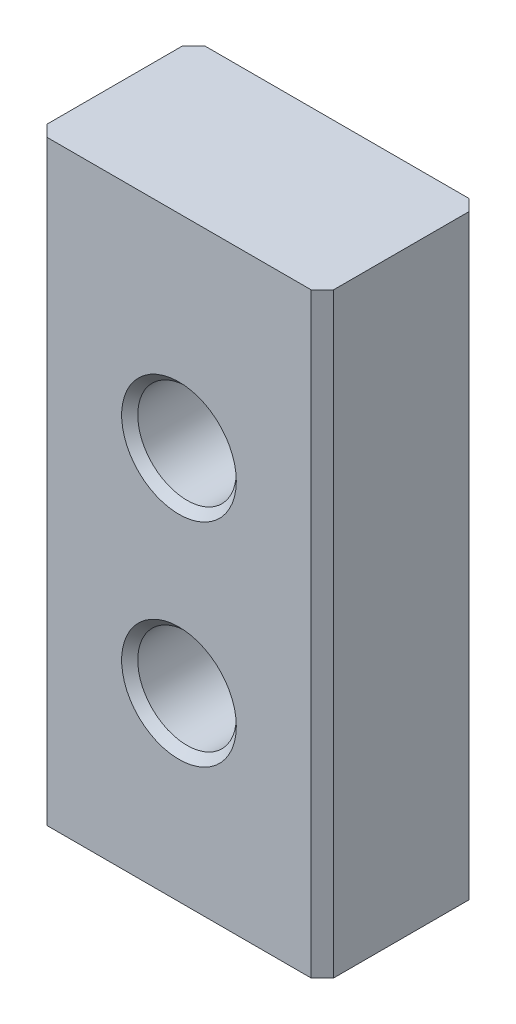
from build123d import *

# Parameters (mm, degrees)
SKETCH1_W                           = 12.7
SKETCH1_H                           = 26.4
EXTRUDE1_DEPTH                      = 7
F_0_17188_DIAMETER_HOLE1_AT_2_COUNT = 2
F_0_17188_DIAMETER_HOLE1_AT_2_PITCH = 9.4
CHAMFER2_SIZE                       = 0.5


with BuildPart() as part:
    # Sketch1 → Extrude1 (new body)
    with BuildSketch(Plane.XY):
        with Locations((0, 13.2)):
            Rectangle(SKETCH1_W, SKETCH1_H)
    extrude(amount=EXTRUDE1_DEPTH)

    # Sketch3 → 0.17188_ Diameter Hole1 (revolve, cut)
    with BuildSketch(Plane(origin=(0, 8, 7), x_dir=(0, -1, 0), z_dir=(1, 0, 0))):
        Polygon((0, 0), (0, 7), (2.54, 7), (2.182876, 6.642876), (2.182876, 0.357124), (2.54, 0), align=None)
    f_0_17188_diameter_hole1 = revolve(axis=Axis((0, 8, 13.35), (0, 0, -1)), mode=Mode.SUBTRACT)

    # 0.17188_ Diameter Hole1 at 2: 0.17188_ Diameter Hole1 ×2
    with Locations(*[(0, i * F_0_17188_DIAMETER_HOLE1_AT_2_PITCH, 0) for i in range(1, F_0_17188_DIAMETER_HOLE1_AT_2_COUNT)]):
        add(f_0_17188_diameter_hole1, mode=Mode.SUBTRACT)

    # Chamfer2
    chamfer2_edges = [part.edges().sort_by_distance(p)[0] for p in [
        (6.35, 13.2, 7),
        (-6.35, 13.2, 7),
        (6.35, 13.2, 0),
        (-6.35, 13.2, 0),
    ]]
    chamfer(chamfer2_edges, length=CHAMFER2_SIZE)


solid = part.part
